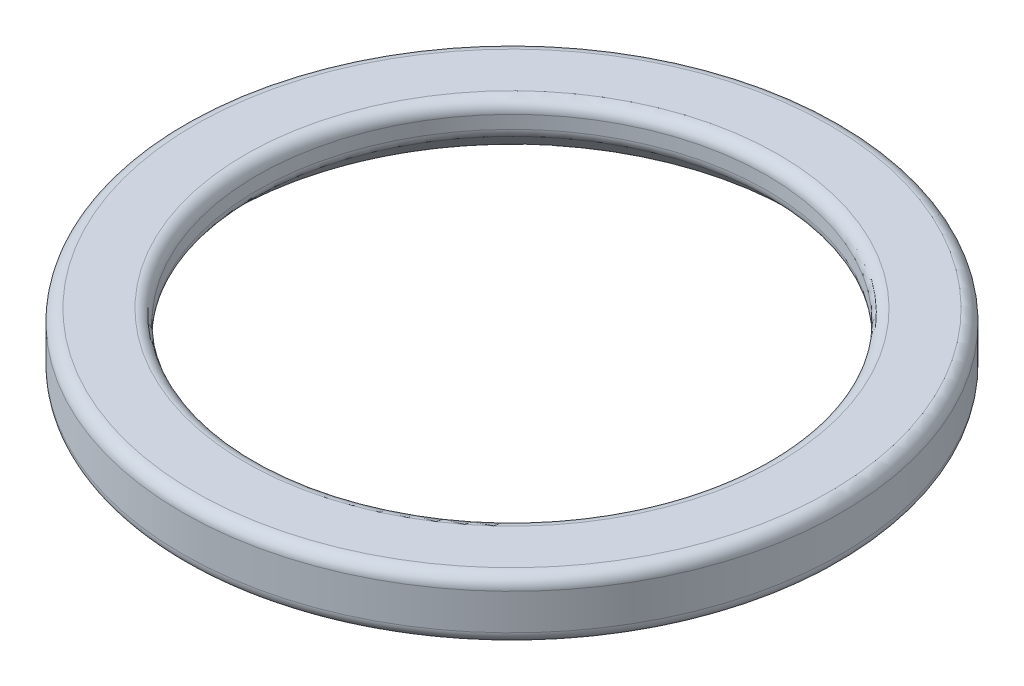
ISO-10303-21;
HEADER;
FILE_DESCRIPTION(('STEP AP214'),'2;1');
FILE_NAME('part.step','',(''),(''),'','','');
FILE_SCHEMA(('AUTOMOTIVE_DESIGN { 1 0 10303 214 1 1 1 1 }'));
ENDSEC;
DATA;
#1=APPLICATION_CONTEXT('core data for automotive mechanical design processes');
#2=APPLICATION_PROTOCOL_DEFINITION('international standard','automotive_design',2000,#1);
#3=PRODUCT_CONTEXT('',#1,'mechanical');
#4=PRODUCT('Part','Part','',(#3));
#5=PRODUCT_RELATED_PRODUCT_CATEGORY('part','',(#4));
#6=PRODUCT_DEFINITION_FORMATION('','',#4);
#7=PRODUCT_DEFINITION_CONTEXT('part definition',#1,'design');
#8=PRODUCT_DEFINITION('design','',#6,#7);
#9=PRODUCT_DEFINITION_SHAPE('','',#8);
#10=(LENGTH_UNIT() NAMED_UNIT(*) SI_UNIT(.MILLI.,.METRE.));
#11=(NAMED_UNIT(*) PLANE_ANGLE_UNIT() SI_UNIT($,.RADIAN.));
#12=(NAMED_UNIT(*) SI_UNIT($,.STERADIAN.) SOLID_ANGLE_UNIT());
#13=UNCERTAINTY_MEASURE_WITH_UNIT(LENGTH_MEASURE(1.E-05),#10,'distance_accuracy_value','');
#14=(GEOMETRIC_REPRESENTATION_CONTEXT(3) GLOBAL_UNCERTAINTY_ASSIGNED_CONTEXT((#13)) GLOBAL_UNIT_ASSIGNED_CONTEXT((#10,
#11,#12)) REPRESENTATION_CONTEXT('',''));
#15=CARTESIAN_POINT('',(0.,0.,0.));
#16=DIRECTION('',(0.,0.,1.));
#17=DIRECTION('',(1.,0.,0.));
#18=AXIS2_PLACEMENT_3D('',#15,#16,#17);
#19=CARTESIAN_POINT('',(0.0068739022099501,1.6,0.));
#20=DIRECTION('',(0.,-1.,0.));
#21=DIRECTION('',(0.,0.,-1.));
#22=AXIS2_PLACEMENT_3D('',#19,#20,#21);
#23=TOROIDAL_SURFACE('',#22,8.9,0.4);
#24=CARTESIAN_POINT('',(0.0068739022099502,1.6,0.));
#25=DIRECTION('',(0.,-1.,0.));
#26=DIRECTION('',(0.,0.,-1.));
#27=AXIS2_PLACEMENT_3D('',#24,#25,#26);
#28=CIRCLE('',#27,8.5);
#29=CARTESIAN_POINT('',(0.0068739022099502,1.6,-8.5));
#30=VERTEX_POINT('',#29);
#31=EDGE_CURVE('E64',#30,#30,#28,.T.);
#32=ORIENTED_EDGE('',*,*,#31,.T.);
#33=EDGE_LOOP('',(#32));
#34=FACE_BOUND('',#33,.T.);
#35=CARTESIAN_POINT('',(0.0068739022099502,2.,0.));
#36=DIRECTION('',(0.,-1.,0.));
#37=DIRECTION('',(0.,0.,-1.));
#38=AXIS2_PLACEMENT_3D('',#35,#36,#37);
#39=CIRCLE('',#38,8.9);
#40=CARTESIAN_POINT('',(0.0068739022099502,2.,-8.9));
#41=VERTEX_POINT('',#40);
#42=EDGE_CURVE('E10',#41,#41,#39,.T.);
#43=ORIENTED_EDGE('',*,*,#42,.F.);
#44=EDGE_LOOP('',(#43));
#45=FACE_BOUND('',#44,.T.);
#46=ADVANCED_FACE('F30',(#34,#45),#23,.T.);
#47=CARTESIAN_POINT('',(8.90687390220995,2.,0.));
#48=DIRECTION('',(0.,1.,0.));
#49=DIRECTION('',(0.,0.,1.));
#50=AXIS2_PLACEMENT_3D('',#47,#48,#49);
#51=PLANE('',#50);
#52=ORIENTED_EDGE('',*,*,#42,.T.);
#53=EDGE_LOOP('',(#52));
#54=FACE_BOUND('',#53,.T.);
#55=CARTESIAN_POINT('',(0.0068739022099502,2.,0.));
#56=DIRECTION('',(0.,-1.,0.));
#57=DIRECTION('',(0.,0.,-1.));
#58=AXIS2_PLACEMENT_3D('',#55,#56,#57);
#59=CIRCLE('',#58,10.6);
#60=CARTESIAN_POINT('',(0.0068739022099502,2.,-10.6));
#61=VERTEX_POINT('',#60);
#62=EDGE_CURVE('E36',#61,#61,#59,.T.);
#63=ORIENTED_EDGE('',*,*,#62,.F.);
#64=EDGE_LOOP('',(#63));
#65=FACE_BOUND('',#64,.T.);
#66=ADVANCED_FACE('F82',(#54,#65),#51,.T.);
#67=CARTESIAN_POINT('',(0.0068739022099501,1.6,0.));
#68=DIRECTION('',(0.,-1.,0.));
#69=DIRECTION('',(0.,0.,-1.));
#70=AXIS2_PLACEMENT_3D('',#67,#68,#69);
#71=TOROIDAL_SURFACE('',#70,10.6,0.4);
#72=ORIENTED_EDGE('',*,*,#62,.T.);
#73=EDGE_LOOP('',(#72));
#74=FACE_BOUND('',#73,.T.);
#75=CARTESIAN_POINT('',(0.0068739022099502,1.6,0.));
#76=DIRECTION('',(0.,-1.,0.));
#77=DIRECTION('',(0.,0.,-1.));
#78=AXIS2_PLACEMENT_3D('',#75,#76,#77);
#79=CIRCLE('',#78,11.);
#80=CARTESIAN_POINT('',(0.0068739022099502,1.6,-11.));
#81=VERTEX_POINT('',#80);
#82=EDGE_CURVE('E40',#81,#81,#79,.T.);
#83=ORIENTED_EDGE('',*,*,#82,.F.);
#84=EDGE_LOOP('',(#83));
#85=FACE_BOUND('',#84,.T.);
#86=ADVANCED_FACE('F86',(#74,#85),#71,.T.);
#87=CARTESIAN_POINT('',(0.0068739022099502,0.,0.));
#88=DIRECTION('',(0.,-1.,0.));
#89=DIRECTION('',(0.,0.,-1.));
#90=AXIS2_PLACEMENT_3D('',#87,#88,#89);
#91=CYLINDRICAL_SURFACE('',#90,11.);
#92=ORIENTED_EDGE('',*,*,#82,.T.);
#93=EDGE_LOOP('',(#92));
#94=FACE_BOUND('',#93,.T.);
#95=CARTESIAN_POINT('',(0.0068739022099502,0.400000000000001,0.));
#96=DIRECTION('',(0.,-1.,0.));
#97=DIRECTION('',(0.,0.,-1.));
#98=AXIS2_PLACEMENT_3D('',#95,#96,#97);
#99=CIRCLE('',#98,11.);
#100=CARTESIAN_POINT('',(0.0068739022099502,0.400000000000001,-11.));
#101=VERTEX_POINT('',#100);
#102=EDGE_CURVE('E44',#101,#101,#99,.T.);
#103=ORIENTED_EDGE('',*,*,#102,.F.);
#104=EDGE_LOOP('',(#103));
#105=FACE_BOUND('',#104,.T.);
#106=ADVANCED_FACE('F90',(#94,#105),#91,.T.);
#107=CARTESIAN_POINT('',(0.0068739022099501,0.400000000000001,0.));
#108=DIRECTION('',(0.,-1.,0.));
#109=DIRECTION('',(0.,0.,-1.));
#110=AXIS2_PLACEMENT_3D('',#107,#108,#109);
#111=TOROIDAL_SURFACE('',#110,10.6,0.4);
#112=ORIENTED_EDGE('',*,*,#102,.T.);
#113=EDGE_LOOP('',(#112));
#114=FACE_BOUND('',#113,.T.);
#115=CARTESIAN_POINT('',(0.0068739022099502,0.,0.));
#116=DIRECTION('',(0.,-1.,0.));
#117=DIRECTION('',(0.,0.,-1.));
#118=AXIS2_PLACEMENT_3D('',#115,#116,#117);
#119=CIRCLE('',#118,10.6);
#120=CARTESIAN_POINT('',(0.0068739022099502,0.,-10.6));
#121=VERTEX_POINT('',#120);
#122=EDGE_CURVE('E49',#121,#121,#119,.T.);
#123=ORIENTED_EDGE('',*,*,#122,.F.);
#124=EDGE_LOOP('',(#123));
#125=FACE_BOUND('',#124,.T.);
#126=ADVANCED_FACE('F96',(#114,#125),#111,.T.);
#127=CARTESIAN_POINT('',(9.67255932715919,0.,0.));
#128=DIRECTION('',(0.,-1.,0.));
#129=DIRECTION('',(0.,0.,-1.));
#130=AXIS2_PLACEMENT_3D('',#127,#128,#129);
#131=PLANE('',#130);
#132=ORIENTED_EDGE('',*,*,#122,.T.);
#133=EDGE_LOOP('',(#132));
#134=FACE_BOUND('',#133,.T.);
#135=CARTESIAN_POINT('',(0.0068739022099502,0.,0.));
#136=DIRECTION('',(0.,-1.,0.));
#137=DIRECTION('',(0.,0.,-1.));
#138=AXIS2_PLACEMENT_3D('',#135,#136,#137);
#139=CIRCLE('',#138,9.66568542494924);
#140=CARTESIAN_POINT('',(0.0068739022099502,0.,-9.66568542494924));
#141=VERTEX_POINT('',#140);
#142=EDGE_CURVE('E52',#141,#141,#139,.T.);
#143=ORIENTED_EDGE('',*,*,#142,.F.);
#144=EDGE_LOOP('',(#143));
#145=FACE_BOUND('',#144,.T.);
#146=ADVANCED_FACE('F100',(#134,#145),#131,.T.);
#147=CARTESIAN_POINT('',(0.0068739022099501,0.4,0.));
#148=DIRECTION('',(0.,-1.,0.));
#149=DIRECTION('',(0.,0.,-1.));
#150=AXIS2_PLACEMENT_3D('',#147,#148,#149);
#151=TOROIDAL_SURFACE('',#150,9.66568542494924,0.4);
#152=ORIENTED_EDGE('',*,*,#142,.T.);
#153=EDGE_LOOP('',(#152));
#154=FACE_BOUND('',#153,.T.);
#155=CARTESIAN_POINT('',(0.0068739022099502,0.117157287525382,0.));
#156=DIRECTION('',(0.,-1.,0.));
#157=DIRECTION('',(0.,0.,-1.));
#158=AXIS2_PLACEMENT_3D('',#155,#156,#157);
#159=CIRCLE('',#158,9.38284271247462);
#160=CARTESIAN_POINT('',(0.0068739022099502,0.117157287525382,-9.38284271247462));
#161=VERTEX_POINT('',#160);
#162=EDGE_CURVE('E55',#161,#161,#159,.T.);
#163=ORIENTED_EDGE('',*,*,#162,.F.);
#164=EDGE_LOOP('',(#163));
#165=FACE_BOUND('',#164,.T.);
#166=ADVANCED_FACE('F104',(#154,#165),#151,.T.);
#167=CARTESIAN_POINT('',(0.0068739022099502,0.882842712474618,0.));
#168=DIRECTION('',(0.,-1.,0.));
#169=DIRECTION('',(0.,0.,-1.));
#170=AXIS2_PLACEMENT_3D('',#167,#168,#169);
#171=CONICAL_SURFACE('',#170,8.61715728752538,0.785398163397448);
#172=ORIENTED_EDGE('',*,*,#162,.T.);
#173=EDGE_LOOP('',(#172));
#174=FACE_BOUND('',#173,.T.);
#175=CARTESIAN_POINT('',(0.0068739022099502,0.882842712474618,0.));
#176=DIRECTION('',(0.,-1.,0.));
#177=DIRECTION('',(0.,0.,-1.));
#178=AXIS2_PLACEMENT_3D('',#175,#176,#177);
#179=CIRCLE('',#178,8.61715728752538);
#180=CARTESIAN_POINT('',(0.0068739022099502,0.882842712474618,-8.61715728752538));
#181=VERTEX_POINT('',#180);
#182=EDGE_CURVE('E58',#181,#181,#179,.T.);
#183=ORIENTED_EDGE('',*,*,#182,.F.);
#184=EDGE_LOOP('',(#183));
#185=FACE_BOUND('',#184,.T.);
#186=ADVANCED_FACE('F78',(#174,#185),#171,.F.);
#187=CARTESIAN_POINT('',(0.0068739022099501,1.16568542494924,0.));
#188=DIRECTION('',(0.,-1.,0.));
#189=DIRECTION('',(0.,0.,-1.));
#190=AXIS2_PLACEMENT_3D('',#187,#188,#189);
#191=TOROIDAL_SURFACE('',#190,8.9,0.4);
#192=ORIENTED_EDGE('',*,*,#182,.T.);
#193=EDGE_LOOP('',(#192));
#194=FACE_BOUND('',#193,.T.);
#195=CARTESIAN_POINT('',(0.0068739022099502,1.16568542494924,0.));
#196=DIRECTION('',(0.,-1.,0.));
#197=DIRECTION('',(0.,0.,-1.));
#198=AXIS2_PLACEMENT_3D('',#195,#196,#197);
#199=CIRCLE('',#198,8.5);
#200=CARTESIAN_POINT('',(0.0068739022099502,1.16568542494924,-8.5));
#201=VERTEX_POINT('',#200);
#202=EDGE_CURVE('E61',#201,#201,#199,.T.);
#203=ORIENTED_EDGE('',*,*,#202,.F.);
#204=EDGE_LOOP('',(#203));
#205=FACE_BOUND('',#204,.T.);
#206=ADVANCED_FACE('F72',(#194,#205),#191,.T.);
#207=CARTESIAN_POINT('',(0.0068739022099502,0.,0.));
#208=DIRECTION('',(0.,-1.,0.));
#209=DIRECTION('',(0.,0.,-1.));
#210=AXIS2_PLACEMENT_3D('',#207,#208,#209);
#211=CYLINDRICAL_SURFACE('',#210,8.5);
#212=ORIENTED_EDGE('',*,*,#202,.T.);
#213=EDGE_LOOP('',(#212));
#214=FACE_BOUND('',#213,.T.);
#215=ORIENTED_EDGE('',*,*,#31,.F.);
#216=EDGE_LOOP('',(#215));
#217=FACE_BOUND('',#216,.T.);
#218=ADVANCED_FACE('F70',(#214,#217),#211,.F.);
#219=CLOSED_SHELL('',(#46,#66,#86,#106,#126,#146,#166,#186,#206,#218));
#220=MANIFOLD_SOLID_BREP('B2',#219);
#221=ADVANCED_BREP_SHAPE_REPRESENTATION('',(#18,#220),#14);
#222=SHAPE_DEFINITION_REPRESENTATION(#9,#221);
ENDSEC;
END-ISO-10303-21;
